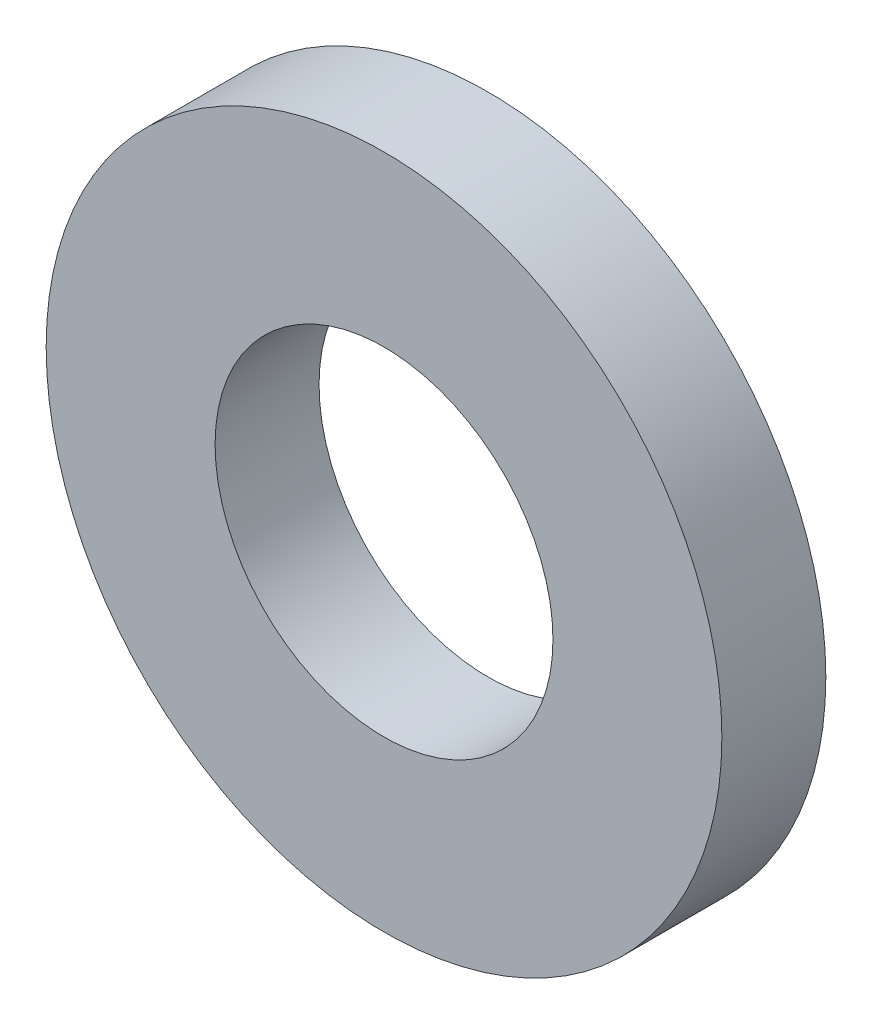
from build123d import *

# Parameters (mm, degrees)
ESQUISSE1_R          = 6.5
ESQUISSE1_R_2        = 3.25
BASE_EXTRUSION_DEPTH = 2


with BuildPart() as part:
    # Esquisse1 → Base-Extrusion (new body)
    with BuildSketch(Plane.XY):
        Circle(ESQUISSE1_R)
        Circle(ESQUISSE1_R_2, mode=Mode.SUBTRACT)
    extrude(amount=BASE_EXTRUSION_DEPTH)


solid = part.part
